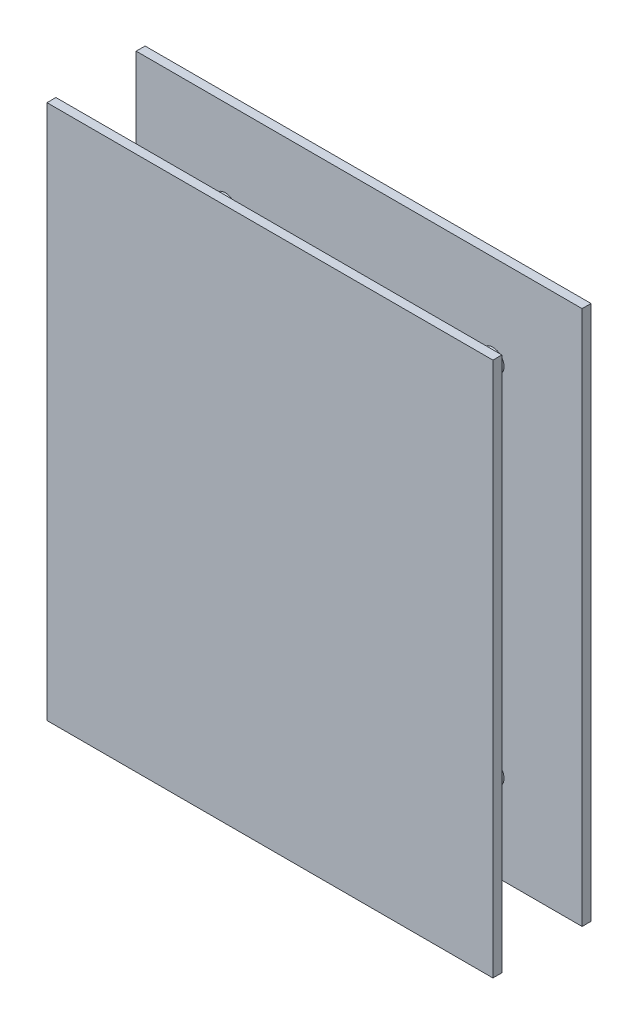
ISO-10303-21;
HEADER;
FILE_DESCRIPTION(('STEP AP214'),'2;1');
FILE_NAME('part.step','',(''),(''),'','','');
FILE_SCHEMA(('AUTOMOTIVE_DESIGN { 1 0 10303 214 1 1 1 1 }'));
ENDSEC;
DATA;
#1=APPLICATION_CONTEXT('core data for automotive mechanical design processes');
#2=APPLICATION_PROTOCOL_DEFINITION('international standard','automotive_design',2000,#1);
#3=PRODUCT_CONTEXT('',#1,'mechanical');
#4=PRODUCT('Part','Part','',(#3));
#5=PRODUCT_RELATED_PRODUCT_CATEGORY('part','',(#4));
#6=PRODUCT_DEFINITION_FORMATION('','',#4);
#7=PRODUCT_DEFINITION_CONTEXT('part definition',#1,'design');
#8=PRODUCT_DEFINITION('design','',#6,#7);
#9=PRODUCT_DEFINITION_SHAPE('','',#8);
#10=(LENGTH_UNIT() NAMED_UNIT(*) SI_UNIT(.MILLI.,.METRE.));
#11=(NAMED_UNIT(*) PLANE_ANGLE_UNIT() SI_UNIT($,.RADIAN.));
#12=(NAMED_UNIT(*) SI_UNIT($,.STERADIAN.) SOLID_ANGLE_UNIT());
#13=UNCERTAINTY_MEASURE_WITH_UNIT(LENGTH_MEASURE(1.E-05),#10,'distance_accuracy_value','');
#14=(GEOMETRIC_REPRESENTATION_CONTEXT(3) GLOBAL_UNCERTAINTY_ASSIGNED_CONTEXT((#13)) GLOBAL_UNIT_ASSIGNED_CONTEXT((#10,
#11,#12)) REPRESENTATION_CONTEXT('',''));
#15=CARTESIAN_POINT('',(0.,0.,0.));
#16=DIRECTION('',(0.,0.,1.));
#17=DIRECTION('',(1.,0.,0.));
#18=AXIS2_PLACEMENT_3D('',#15,#16,#17);
#19=CARTESIAN_POINT('',(0.,120.,2.));
#20=DIRECTION('',(0.,0.,-1.));
#21=DIRECTION('',(-1.,0.,0.));
#22=AXIS2_PLACEMENT_3D('',#19,#20,#21);
#23=PLANE('',#22);
#24=CARTESIAN_POINT('',(25.,72.5,2.));
#25=DIRECTION('',(0.,0.,-1.));
#26=DIRECTION('',(-1.,0.,0.));
#27=AXIS2_PLACEMENT_3D('',#24,#25,#26);
#28=CIRCLE('',#27,1.75);
#29=CARTESIAN_POINT('',(23.25,72.5,2.));
#30=VERTEX_POINT('',#29);
#31=EDGE_CURVE('E420',#30,#30,#28,.T.);
#32=ORIENTED_EDGE('',*,*,#31,.T.);
#33=EDGE_LOOP('',(#32));
#34=FACE_BOUND('',#33,.T.);
#35=CARTESIAN_POINT('',(25.,47.5,2.));
#36=DIRECTION('',(0.,0.,-1.));
#37=DIRECTION('',(-1.,0.,0.));
#38=AXIS2_PLACEMENT_3D('',#35,#36,#37);
#39=CIRCLE('',#38,1.75);
#40=CARTESIAN_POINT('',(23.25,47.5,2.));
#41=VERTEX_POINT('',#40);
#42=EDGE_CURVE('E414',#41,#41,#39,.T.);
#43=ORIENTED_EDGE('',*,*,#42,.T.);
#44=EDGE_LOOP('',(#43));
#45=FACE_BOUND('',#44,.T.);
#46=CARTESIAN_POINT('',(75.,47.5,2.));
#47=DIRECTION('',(0.,0.,-1.));
#48=DIRECTION('',(-1.,0.,0.));
#49=AXIS2_PLACEMENT_3D('',#46,#47,#48);
#50=CIRCLE('',#49,1.75);
#51=CARTESIAN_POINT('',(73.25,47.5,2.));
#52=VERTEX_POINT('',#51);
#53=EDGE_CURVE('E406',#52,#52,#50,.T.);
#54=ORIENTED_EDGE('',*,*,#53,.T.);
#55=EDGE_LOOP('',(#54));
#56=FACE_BOUND('',#55,.T.);
#57=CARTESIAN_POINT('',(75.,72.5,2.));
#58=DIRECTION('',(0.,0.,-1.));
#59=DIRECTION('',(-1.,0.,0.));
#60=AXIS2_PLACEMENT_3D('',#57,#58,#59);
#61=CIRCLE('',#60,1.75);
#62=CARTESIAN_POINT('',(73.25,72.5,2.));
#63=VERTEX_POINT('',#62);
#64=EDGE_CURVE('E399',#63,#63,#61,.T.);
#65=ORIENTED_EDGE('',*,*,#64,.T.);
#66=EDGE_LOOP('',(#65));
#67=FACE_BOUND('',#66,.T.);
#68=CARTESIAN_POINT('',(80.,100.,2.));
#69=DIRECTION('',(0.,0.,-1.));
#70=DIRECTION('',(-1.,0.,0.));
#71=AXIS2_PLACEMENT_3D('',#68,#69,#70);
#72=CIRCLE('',#71,2.50000000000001);
#73=CARTESIAN_POINT('',(77.5,100.,2.));
#74=VERTEX_POINT('',#73);
#75=EDGE_CURVE('E42',#74,#74,#72,.F.);
#76=ORIENTED_EDGE('',*,*,#75,.F.);
#77=EDGE_LOOP('',(#76));
#78=FACE_BOUND('',#77,.T.);
#79=CARTESIAN_POINT('',(20.,20.,2.));
#80=DIRECTION('',(0.,0.,-1.));
#81=DIRECTION('',(-1.,0.,0.));
#82=AXIS2_PLACEMENT_3D('',#79,#80,#81);
#83=CIRCLE('',#82,2.5);
#84=CARTESIAN_POINT('',(17.5,20.,2.));
#85=VERTEX_POINT('',#84);
#86=EDGE_CURVE('E172',#85,#85,#83,.F.);
#87=ORIENTED_EDGE('',*,*,#86,.F.);
#88=EDGE_LOOP('',(#87));
#89=FACE_BOUND('',#88,.T.);
#90=DIRECTION('',(0.,-1.,0.));
#91=VECTOR('',#90,1.);
#92=CARTESIAN_POINT('',(0.,0.,2.));
#93=LINE('',#92,#91);
#94=CARTESIAN_POINT('',(0.,120.,2.));
#95=VERTEX_POINT('',#94);
#96=CARTESIAN_POINT('',(0.,0.,2.));
#97=VERTEX_POINT('',#96);
#98=EDGE_CURVE('E152',#95,#97,#93,.T.);
#99=ORIENTED_EDGE('',*,*,#98,.T.);
#100=DIRECTION('',(1.,0.,0.));
#101=VECTOR('',#100,1.);
#102=CARTESIAN_POINT('',(0.,0.,2.));
#103=LINE('',#102,#101);
#104=CARTESIAN_POINT('',(100.,0.,2.));
#105=VERTEX_POINT('',#104);
#106=EDGE_CURVE('E82',#97,#105,#103,.T.);
#107=ORIENTED_EDGE('',*,*,#106,.T.);
#108=DIRECTION('',(0.,1.,0.));
#109=VECTOR('',#108,1.);
#110=CARTESIAN_POINT('',(100.,0.,2.));
#111=LINE('',#110,#109);
#112=CARTESIAN_POINT('',(100.,120.,2.));
#113=VERTEX_POINT('',#112);
#114=EDGE_CURVE('E155',#105,#113,#111,.T.);
#115=ORIENTED_EDGE('',*,*,#114,.T.);
#116=DIRECTION('',(-1.,0.,0.));
#117=VECTOR('',#116,1.);
#118=CARTESIAN_POINT('',(0.,120.,2.));
#119=LINE('',#118,#117);
#120=EDGE_CURVE('E50',#113,#95,#119,.T.);
#121=ORIENTED_EDGE('',*,*,#120,.T.);
#122=EDGE_LOOP('',(#99,#107,#115,#121));
#123=FACE_BOUND('',#122,.T.);
#124=CARTESIAN_POINT('',(20.,100.,2.));
#125=DIRECTION('',(0.,0.,-1.));
#126=DIRECTION('',(-1.,0.,0.));
#127=AXIS2_PLACEMENT_3D('',#124,#125,#126);
#128=CIRCLE('',#127,2.5);
#129=CARTESIAN_POINT('',(17.5,100.,2.));
#130=VERTEX_POINT('',#129);
#131=EDGE_CURVE('E175',#130,#130,#128,.F.);
#132=ORIENTED_EDGE('',*,*,#131,.F.);
#133=EDGE_LOOP('',(#132));
#134=FACE_BOUND('',#133,.T.);
#135=CARTESIAN_POINT('',(80.,20.,2.));
#136=DIRECTION('',(0.,0.,-1.));
#137=DIRECTION('',(-1.,0.,0.));
#138=AXIS2_PLACEMENT_3D('',#135,#136,#137);
#139=CIRCLE('',#138,2.49999999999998);
#140=CARTESIAN_POINT('',(77.5,20.,2.));
#141=VERTEX_POINT('',#140);
#142=EDGE_CURVE('E11',#141,#141,#139,.F.);
#143=ORIENTED_EDGE('',*,*,#142,.F.);
#144=EDGE_LOOP('',(#143));
#145=FACE_BOUND('',#144,.T.);
#146=ADVANCED_FACE('F33',(#34,#45,#56,#67,#78,#89,#123,#134,#145),#23,.F.);
#147=CARTESIAN_POINT('',(0.,0.,2.));
#148=DIRECTION('',(1.,0.,0.));
#149=DIRECTION('',(0.,0.,-1.));
#150=AXIS2_PLACEMENT_3D('',#147,#148,#149);
#151=PLANE('',#150);
#152=DIRECTION('',(0.,-1.,0.));
#153=VECTOR('',#152,1.);
#154=CARTESIAN_POINT('',(0.,0.,0.));
#155=LINE('',#154,#153);
#156=CARTESIAN_POINT('',(0.,120.,0.));
#157=VERTEX_POINT('',#156);
#158=CARTESIAN_POINT('',(0.,0.,0.));
#159=VERTEX_POINT('',#158);
#160=EDGE_CURVE('E151',#157,#159,#155,.T.);
#161=ORIENTED_EDGE('',*,*,#160,.T.);
#162=DIRECTION('',(0.,0.,-1.));
#163=VECTOR('',#162,1.);
#164=CARTESIAN_POINT('',(0.,0.,2.));
#165=LINE('',#164,#163);
#166=EDGE_CURVE('E170',#97,#159,#165,.T.);
#167=ORIENTED_EDGE('',*,*,#166,.F.);
#168=ORIENTED_EDGE('',*,*,#98,.F.);
#169=DIRECTION('',(0.,0.,-1.));
#170=VECTOR('',#169,1.);
#171=CARTESIAN_POINT('',(0.,120.,2.));
#172=LINE('',#171,#170);
#173=EDGE_CURVE('E158',#95,#157,#172,.T.);
#174=ORIENTED_EDGE('',*,*,#173,.T.);
#175=EDGE_LOOP('',(#161,#167,#168,#174));
#176=FACE_BOUND('',#175,.T.);
#177=ADVANCED_FACE('F35',(#176),#151,.F.);
#178=CARTESIAN_POINT('',(0.,0.,2.));
#179=DIRECTION('',(0.,1.,0.));
#180=DIRECTION('',(0.,0.,1.));
#181=AXIS2_PLACEMENT_3D('',#178,#179,#180);
#182=PLANE('',#181);
#183=DIRECTION('',(1.,0.,0.));
#184=VECTOR('',#183,1.);
#185=CARTESIAN_POINT('',(0.,0.,0.));
#186=LINE('',#185,#184);
#187=CARTESIAN_POINT('',(100.,0.,0.));
#188=VERTEX_POINT('',#187);
#189=EDGE_CURVE('E161',#159,#188,#186,.T.);
#190=ORIENTED_EDGE('',*,*,#189,.T.);
#191=DIRECTION('',(0.,0.,-1.));
#192=VECTOR('',#191,1.);
#193=CARTESIAN_POINT('',(100.,0.,2.));
#194=LINE('',#193,#192);
#195=EDGE_CURVE('E168',#105,#188,#194,.T.);
#196=ORIENTED_EDGE('',*,*,#195,.F.);
#197=ORIENTED_EDGE('',*,*,#106,.F.);
#198=ORIENTED_EDGE('',*,*,#166,.T.);
#199=EDGE_LOOP('',(#190,#196,#197,#198));
#200=FACE_BOUND('',#199,.T.);
#201=ADVANCED_FACE('F228',(#200),#182,.F.);
#202=CARTESIAN_POINT('',(100.,0.,2.));
#203=DIRECTION('',(-1.,0.,0.));
#204=DIRECTION('',(0.,0.,1.));
#205=AXIS2_PLACEMENT_3D('',#202,#203,#204);
#206=PLANE('',#205);
#207=DIRECTION('',(0.,1.,0.));
#208=VECTOR('',#207,1.);
#209=CARTESIAN_POINT('',(100.,0.,0.));
#210=LINE('',#209,#208);
#211=CARTESIAN_POINT('',(100.,120.,0.));
#212=VERTEX_POINT('',#211);
#213=EDGE_CURVE('E68',#188,#212,#210,.T.);
#214=ORIENTED_EDGE('',*,*,#213,.T.);
#215=DIRECTION('',(0.,0.,-1.));
#216=VECTOR('',#215,1.);
#217=CARTESIAN_POINT('',(100.,120.,2.));
#218=LINE('',#217,#216);
#219=EDGE_CURVE('E166',#113,#212,#218,.T.);
#220=ORIENTED_EDGE('',*,*,#219,.F.);
#221=ORIENTED_EDGE('',*,*,#114,.F.);
#222=ORIENTED_EDGE('',*,*,#195,.T.);
#223=EDGE_LOOP('',(#214,#220,#221,#222));
#224=FACE_BOUND('',#223,.T.);
#225=ADVANCED_FACE('F226',(#224),#206,.F.);
#226=CARTESIAN_POINT('',(0.,120.,2.));
#227=DIRECTION('',(0.,-1.,0.));
#228=DIRECTION('',(0.,0.,-1.));
#229=AXIS2_PLACEMENT_3D('',#226,#227,#228);
#230=PLANE('',#229);
#231=DIRECTION('',(-1.,0.,0.));
#232=VECTOR('',#231,1.);
#233=CARTESIAN_POINT('',(0.,120.,0.));
#234=LINE('',#233,#232);
#235=EDGE_CURVE('E74',#212,#157,#234,.T.);
#236=ORIENTED_EDGE('',*,*,#235,.T.);
#237=ORIENTED_EDGE('',*,*,#173,.F.);
#238=ORIENTED_EDGE('',*,*,#120,.F.);
#239=ORIENTED_EDGE('',*,*,#219,.T.);
#240=EDGE_LOOP('',(#236,#237,#238,#239));
#241=FACE_BOUND('',#240,.T.);
#242=ADVANCED_FACE('F222',(#241),#230,.F.);
#243=CARTESIAN_POINT('',(0.,120.,0.));
#244=DIRECTION('',(0.,0.,-1.));
#245=DIRECTION('',(-1.,0.,0.));
#246=AXIS2_PLACEMENT_3D('',#243,#244,#245);
#247=PLANE('',#246);
#248=CARTESIAN_POINT('',(25.,72.5,0.));
#249=DIRECTION('',(0.,0.,-1.));
#250=DIRECTION('',(-1.,0.,0.));
#251=AXIS2_PLACEMENT_3D('',#248,#249,#250);
#252=CIRCLE('',#251,1.75);
#253=CARTESIAN_POINT('',(23.25,72.5,0.));
#254=VERTEX_POINT('',#253);
#255=EDGE_CURVE('E423',#254,#254,#252,.T.);
#256=ORIENTED_EDGE('',*,*,#255,.F.);
#257=EDGE_LOOP('',(#256));
#258=FACE_BOUND('',#257,.T.);
#259=CARTESIAN_POINT('',(25.,47.5,0.));
#260=DIRECTION('',(0.,0.,-1.));
#261=DIRECTION('',(-1.,0.,0.));
#262=AXIS2_PLACEMENT_3D('',#259,#260,#261);
#263=CIRCLE('',#262,1.75);
#264=CARTESIAN_POINT('',(23.25,47.5,0.));
#265=VERTEX_POINT('',#264);
#266=EDGE_CURVE('E417',#265,#265,#263,.T.);
#267=ORIENTED_EDGE('',*,*,#266,.F.);
#268=EDGE_LOOP('',(#267));
#269=FACE_BOUND('',#268,.T.);
#270=CARTESIAN_POINT('',(75.,47.5,0.));
#271=DIRECTION('',(0.,0.,-1.));
#272=DIRECTION('',(-1.,0.,0.));
#273=AXIS2_PLACEMENT_3D('',#270,#271,#272);
#274=CIRCLE('',#273,1.75);
#275=CARTESIAN_POINT('',(73.25,47.5,0.));
#276=VERTEX_POINT('',#275);
#277=EDGE_CURVE('E411',#276,#276,#274,.T.);
#278=ORIENTED_EDGE('',*,*,#277,.F.);
#279=EDGE_LOOP('',(#278));
#280=FACE_BOUND('',#279,.T.);
#281=CARTESIAN_POINT('',(75.,72.5,0.));
#282=DIRECTION('',(0.,0.,-1.));
#283=DIRECTION('',(-1.,0.,0.));
#284=AXIS2_PLACEMENT_3D('',#281,#282,#283);
#285=CIRCLE('',#284,1.75);
#286=CARTESIAN_POINT('',(73.25,72.5,0.));
#287=VERTEX_POINT('',#286);
#288=EDGE_CURVE('E401',#287,#287,#285,.T.);
#289=ORIENTED_EDGE('',*,*,#288,.F.);
#290=EDGE_LOOP('',(#289));
#291=FACE_BOUND('',#290,.T.);
#292=ORIENTED_EDGE('',*,*,#160,.F.);
#293=ORIENTED_EDGE('',*,*,#235,.F.);
#294=ORIENTED_EDGE('',*,*,#213,.F.);
#295=ORIENTED_EDGE('',*,*,#189,.F.);
#296=EDGE_LOOP('',(#292,#293,#294,#295));
#297=FACE_BOUND('',#296,.T.);
#298=ADVANCED_FACE('F217',(#258,#269,#280,#291,#297),#247,.T.);
#299=CARTESIAN_POINT('',(20.,20.,20.));
#300=DIRECTION('',(0.,0.,-1.));
#301=DIRECTION('',(-1.,0.,0.));
#302=AXIS2_PLACEMENT_3D('',#299,#300,#301);
#303=CYLINDRICAL_SURFACE('',#302,2.5);
#304=CARTESIAN_POINT('',(20.,20.,20.));
#305=DIRECTION('',(0.,0.,1.));
#306=DIRECTION('',(1.,0.,0.));
#307=AXIS2_PLACEMENT_3D('',#304,#305,#306);
#308=CIRCLE('',#307,2.5);
#309=CARTESIAN_POINT('',(22.5,20.,20.));
#310=VERTEX_POINT('',#309);
#311=EDGE_CURVE('E148',#310,#310,#308,.T.);
#312=ORIENTED_EDGE('',*,*,#311,.F.);
#313=EDGE_LOOP('',(#312));
#314=FACE_BOUND('',#313,.T.);
#315=ORIENTED_EDGE('',*,*,#86,.T.);
#316=EDGE_LOOP('',(#315));
#317=FACE_BOUND('',#316,.T.);
#318=ADVANCED_FACE('F214',(#314,#317),#303,.T.);
#319=CARTESIAN_POINT('',(20.,100.,20.));
#320=DIRECTION('',(0.,0.,-1.));
#321=DIRECTION('',(-1.,0.,0.));
#322=AXIS2_PLACEMENT_3D('',#319,#320,#321);
#323=CYLINDRICAL_SURFACE('',#322,2.5);
#324=CARTESIAN_POINT('',(20.,100.,20.));
#325=DIRECTION('',(0.,0.,1.));
#326=DIRECTION('',(1.,0.,0.));
#327=AXIS2_PLACEMENT_3D('',#324,#325,#326);
#328=CIRCLE('',#327,2.5);
#329=CARTESIAN_POINT('',(22.5,100.,20.));
#330=VERTEX_POINT('',#329);
#331=EDGE_CURVE('E145',#330,#330,#328,.T.);
#332=ORIENTED_EDGE('',*,*,#331,.F.);
#333=EDGE_LOOP('',(#332));
#334=FACE_BOUND('',#333,.T.);
#335=ORIENTED_EDGE('',*,*,#131,.T.);
#336=EDGE_LOOP('',(#335));
#337=FACE_BOUND('',#336,.T.);
#338=ADVANCED_FACE('F205',(#334,#337),#323,.T.);
#339=CARTESIAN_POINT('',(80.,100.,20.));
#340=DIRECTION('',(0.,0.,-1.));
#341=DIRECTION('',(-1.,0.,0.));
#342=AXIS2_PLACEMENT_3D('',#339,#340,#341);
#343=CYLINDRICAL_SURFACE('',#342,2.50000000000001);
#344=CARTESIAN_POINT('',(80.,100.,20.));
#345=DIRECTION('',(0.,0.,1.));
#346=DIRECTION('',(1.,0.,0.));
#347=AXIS2_PLACEMENT_3D('',#344,#345,#346);
#348=CIRCLE('',#347,2.50000000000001);
#349=CARTESIAN_POINT('',(82.5,100.,20.));
#350=VERTEX_POINT('',#349);
#351=EDGE_CURVE('E137',#350,#350,#348,.T.);
#352=ORIENTED_EDGE('',*,*,#351,.F.);
#353=EDGE_LOOP('',(#352));
#354=FACE_BOUND('',#353,.T.);
#355=ORIENTED_EDGE('',*,*,#75,.T.);
#356=EDGE_LOOP('',(#355));
#357=FACE_BOUND('',#356,.T.);
#358=ADVANCED_FACE('F180',(#354,#357),#343,.T.);
#359=CARTESIAN_POINT('',(80.,20.,20.));
#360=DIRECTION('',(0.,0.,-1.));
#361=DIRECTION('',(-1.,0.,0.));
#362=AXIS2_PLACEMENT_3D('',#359,#360,#361);
#363=CYLINDRICAL_SURFACE('',#362,2.49999999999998);
#364=CARTESIAN_POINT('',(80.,20.,20.));
#365=DIRECTION('',(0.,0.,1.));
#366=DIRECTION('',(1.,0.,0.));
#367=AXIS2_PLACEMENT_3D('',#364,#365,#366);
#368=CIRCLE('',#367,2.49999999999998);
#369=CARTESIAN_POINT('',(82.5,20.,20.));
#370=VERTEX_POINT('',#369);
#371=EDGE_CURVE('E134',#370,#370,#368,.T.);
#372=ORIENTED_EDGE('',*,*,#371,.F.);
#373=EDGE_LOOP('',(#372));
#374=FACE_BOUND('',#373,.T.);
#375=ORIENTED_EDGE('',*,*,#142,.T.);
#376=EDGE_LOOP('',(#375));
#377=FACE_BOUND('',#376,.T.);
#378=ADVANCED_FACE('F194',(#374,#377),#363,.T.);
#379=CARTESIAN_POINT('',(0.,0.,20.));
#380=DIRECTION('',(0.,0.,1.));
#381=DIRECTION('',(1.,0.,0.));
#382=AXIS2_PLACEMENT_3D('',#379,#380,#381);
#383=PLANE('',#382);
#384=ORIENTED_EDGE('',*,*,#331,.T.);
#385=EDGE_LOOP('',(#384));
#386=FACE_BOUND('',#385,.T.);
#387=ORIENTED_EDGE('',*,*,#371,.T.);
#388=EDGE_LOOP('',(#387));
#389=FACE_BOUND('',#388,.T.);
#390=DIRECTION('',(0.,-1.,0.));
#391=VECTOR('',#390,1.);
#392=CARTESIAN_POINT('',(0.,120.,20.));
#393=LINE('',#392,#391);
#394=CARTESIAN_POINT('',(0.,120.,20.));
#395=VERTEX_POINT('',#394);
#396=CARTESIAN_POINT('',(0.,0.,20.));
#397=VERTEX_POINT('',#396);
#398=EDGE_CURVE('E133',#395,#397,#393,.T.);
#399=ORIENTED_EDGE('',*,*,#398,.F.);
#400=DIRECTION('',(-1.,0.,0.));
#401=VECTOR('',#400,1.);
#402=CARTESIAN_POINT('',(0.,120.,20.));
#403=LINE('',#402,#401);
#404=CARTESIAN_POINT('',(100.,120.,20.));
#405=VERTEX_POINT('',#404);
#406=EDGE_CURVE('E129',#405,#395,#403,.T.);
#407=ORIENTED_EDGE('',*,*,#406,.F.);
#408=DIRECTION('',(0.,1.,0.));
#409=VECTOR('',#408,1.);
#410=CARTESIAN_POINT('',(100.,120.,20.));
#411=LINE('',#410,#409);
#412=CARTESIAN_POINT('',(100.,0.,20.));
#413=VERTEX_POINT('',#412);
#414=EDGE_CURVE('E385',#413,#405,#411,.T.);
#415=ORIENTED_EDGE('',*,*,#414,.F.);
#416=DIRECTION('',(1.,0.,0.));
#417=VECTOR('',#416,1.);
#418=CARTESIAN_POINT('',(0.,0.,20.));
#419=LINE('',#418,#417);
#420=EDGE_CURVE('E389',#397,#413,#419,.T.);
#421=ORIENTED_EDGE('',*,*,#420,.F.);
#422=EDGE_LOOP('',(#399,#407,#415,#421));
#423=FACE_BOUND('',#422,.T.);
#424=ORIENTED_EDGE('',*,*,#351,.T.);
#425=EDGE_LOOP('',(#424));
#426=FACE_BOUND('',#425,.T.);
#427=ORIENTED_EDGE('',*,*,#311,.T.);
#428=EDGE_LOOP('',(#427));
#429=FACE_BOUND('',#428,.T.);
#430=ADVANCED_FACE('F196',(#386,#389,#423,#426,#429),#383,.F.);
#431=CARTESIAN_POINT('',(0.,120.,22.));
#432=DIRECTION('',(1.,0.,0.));
#433=DIRECTION('',(0.,0.,-1.));
#434=AXIS2_PLACEMENT_3D('',#431,#432,#433);
#435=PLANE('',#434);
#436=ORIENTED_EDGE('',*,*,#398,.T.);
#437=DIRECTION('',(0.,0.,-1.));
#438=VECTOR('',#437,1.);
#439=CARTESIAN_POINT('',(0.,0.,22.));
#440=LINE('',#439,#438);
#441=CARTESIAN_POINT('',(0.,0.,22.));
#442=VERTEX_POINT('',#441);
#443=EDGE_CURVE('E113',#442,#397,#440,.T.);
#444=ORIENTED_EDGE('',*,*,#443,.F.);
#445=DIRECTION('',(0.,-1.,0.));
#446=VECTOR('',#445,1.);
#447=CARTESIAN_POINT('',(0.,120.,22.));
#448=LINE('',#447,#446);
#449=CARTESIAN_POINT('',(0.,120.,22.));
#450=VERTEX_POINT('',#449);
#451=EDGE_CURVE('E120',#450,#442,#448,.T.);
#452=ORIENTED_EDGE('',*,*,#451,.F.);
#453=DIRECTION('',(0.,0.,-1.));
#454=VECTOR('',#453,1.);
#455=CARTESIAN_POINT('',(0.,120.,22.));
#456=LINE('',#455,#454);
#457=EDGE_CURVE('E391',#450,#395,#456,.T.);
#458=ORIENTED_EDGE('',*,*,#457,.T.);
#459=EDGE_LOOP('',(#436,#444,#452,#458));
#460=FACE_BOUND('',#459,.T.);
#461=ADVANCED_FACE('F131',(#460),#435,.F.);
#462=CARTESIAN_POINT('',(0.,0.,22.));
#463=DIRECTION('',(0.,1.,0.));
#464=DIRECTION('',(0.,0.,1.));
#465=AXIS2_PLACEMENT_3D('',#462,#463,#464);
#466=PLANE('',#465);
#467=ORIENTED_EDGE('',*,*,#420,.T.);
#468=DIRECTION('',(0.,0.,-1.));
#469=VECTOR('',#468,1.);
#470=CARTESIAN_POINT('',(100.,0.,22.));
#471=LINE('',#470,#469);
#472=CARTESIAN_POINT('',(100.,0.,22.));
#473=VERTEX_POINT('',#472);
#474=EDGE_CURVE('E116',#473,#413,#471,.T.);
#475=ORIENTED_EDGE('',*,*,#474,.F.);
#476=DIRECTION('',(1.,0.,0.));
#477=VECTOR('',#476,1.);
#478=CARTESIAN_POINT('',(0.,0.,22.));
#479=LINE('',#478,#477);
#480=EDGE_CURVE('E109',#442,#473,#479,.T.);
#481=ORIENTED_EDGE('',*,*,#480,.F.);
#482=ORIENTED_EDGE('',*,*,#443,.T.);
#483=EDGE_LOOP('',(#467,#475,#481,#482));
#484=FACE_BOUND('',#483,.T.);
#485=ADVANCED_FACE('F111',(#484),#466,.F.);
#486=CARTESIAN_POINT('',(100.,120.,22.));
#487=DIRECTION('',(-1.,0.,0.));
#488=DIRECTION('',(0.,0.,1.));
#489=AXIS2_PLACEMENT_3D('',#486,#487,#488);
#490=PLANE('',#489);
#491=ORIENTED_EDGE('',*,*,#414,.T.);
#492=DIRECTION('',(0.,0.,-1.));
#493=VECTOR('',#492,1.);
#494=CARTESIAN_POINT('',(100.,120.,22.));
#495=LINE('',#494,#493);
#496=CARTESIAN_POINT('',(100.,120.,22.));
#497=VERTEX_POINT('',#496);
#498=EDGE_CURVE('E139',#497,#405,#495,.T.);
#499=ORIENTED_EDGE('',*,*,#498,.F.);
#500=DIRECTION('',(0.,1.,0.));
#501=VECTOR('',#500,1.);
#502=CARTESIAN_POINT('',(100.,120.,22.));
#503=LINE('',#502,#501);
#504=EDGE_CURVE('E119',#473,#497,#503,.T.);
#505=ORIENTED_EDGE('',*,*,#504,.F.);
#506=ORIENTED_EDGE('',*,*,#474,.T.);
#507=EDGE_LOOP('',(#491,#499,#505,#506));
#508=FACE_BOUND('',#507,.T.);
#509=ADVANCED_FACE('F307',(#508),#490,.F.);
#510=CARTESIAN_POINT('',(0.,120.,22.));
#511=DIRECTION('',(0.,-1.,0.));
#512=DIRECTION('',(0.,0.,-1.));
#513=AXIS2_PLACEMENT_3D('',#510,#511,#512);
#514=PLANE('',#513);
#515=ORIENTED_EDGE('',*,*,#406,.T.);
#516=ORIENTED_EDGE('',*,*,#457,.F.);
#517=DIRECTION('',(-1.,0.,0.));
#518=VECTOR('',#517,1.);
#519=CARTESIAN_POINT('',(0.,120.,22.));
#520=LINE('',#519,#518);
#521=EDGE_CURVE('E125',#497,#450,#520,.T.);
#522=ORIENTED_EDGE('',*,*,#521,.F.);
#523=ORIENTED_EDGE('',*,*,#498,.T.);
#524=EDGE_LOOP('',(#515,#516,#522,#523));
#525=FACE_BOUND('',#524,.T.);
#526=ADVANCED_FACE('F303',(#525),#514,.F.);
#527=CARTESIAN_POINT('',(0.,0.,22.));
#528=DIRECTION('',(0.,0.,1.));
#529=DIRECTION('',(1.,0.,0.));
#530=AXIS2_PLACEMENT_3D('',#527,#528,#529);
#531=PLANE('',#530);
#532=ORIENTED_EDGE('',*,*,#451,.T.);
#533=ORIENTED_EDGE('',*,*,#480,.T.);
#534=ORIENTED_EDGE('',*,*,#504,.T.);
#535=ORIENTED_EDGE('',*,*,#521,.T.);
#536=EDGE_LOOP('',(#532,#533,#534,#535));
#537=FACE_BOUND('',#536,.T.);
#538=ADVANCED_FACE('F123',(#537),#531,.T.);
#539=CARTESIAN_POINT('',(75.,72.5,10.));
#540=DIRECTION('',(0.,0.,-1.));
#541=DIRECTION('',(-1.,0.,0.));
#542=AXIS2_PLACEMENT_3D('',#539,#540,#541);
#543=CYLINDRICAL_SURFACE('',#542,1.75);
#544=ORIENTED_EDGE('',*,*,#288,.T.);
#545=EDGE_LOOP('',(#544));
#546=FACE_BOUND('',#545,.T.);
#547=ORIENTED_EDGE('',*,*,#64,.F.);
#548=EDGE_LOOP('',(#547));
#549=FACE_BOUND('',#548,.T.);
#550=ADVANCED_FACE('F261',(#546,#549),#543,.F.);
#551=CARTESIAN_POINT('',(75.,47.5,10.));
#552=DIRECTION('',(0.,0.,-1.));
#553=DIRECTION('',(-1.,0.,0.));
#554=AXIS2_PLACEMENT_3D('',#551,#552,#553);
#555=CYLINDRICAL_SURFACE('',#554,1.75);
#556=ORIENTED_EDGE('',*,*,#277,.T.);
#557=EDGE_LOOP('',(#556));
#558=FACE_BOUND('',#557,.T.);
#559=ORIENTED_EDGE('',*,*,#53,.F.);
#560=EDGE_LOOP('',(#559));
#561=FACE_BOUND('',#560,.T.);
#562=ADVANCED_FACE('F266',(#558,#561),#555,.F.);
#563=CARTESIAN_POINT('',(25.,47.5,10.));
#564=DIRECTION('',(0.,0.,-1.));
#565=DIRECTION('',(-1.,0.,0.));
#566=AXIS2_PLACEMENT_3D('',#563,#564,#565);
#567=CYLINDRICAL_SURFACE('',#566,1.75);
#568=ORIENTED_EDGE('',*,*,#266,.T.);
#569=EDGE_LOOP('',(#568));
#570=FACE_BOUND('',#569,.T.);
#571=ORIENTED_EDGE('',*,*,#42,.F.);
#572=EDGE_LOOP('',(#571));
#573=FACE_BOUND('',#572,.T.);
#574=ADVANCED_FACE('F276',(#570,#573),#567,.F.);
#575=CARTESIAN_POINT('',(25.,72.5,10.));
#576=DIRECTION('',(0.,0.,-1.));
#577=DIRECTION('',(-1.,0.,0.));
#578=AXIS2_PLACEMENT_3D('',#575,#576,#577);
#579=CYLINDRICAL_SURFACE('',#578,1.75);
#580=ORIENTED_EDGE('',*,*,#255,.T.);
#581=EDGE_LOOP('',(#580));
#582=FACE_BOUND('',#581,.T.);
#583=ORIENTED_EDGE('',*,*,#31,.F.);
#584=EDGE_LOOP('',(#583));
#585=FACE_BOUND('',#584,.T.);
#586=ADVANCED_FACE('F286',(#582,#585),#579,.F.);
#587=CLOSED_SHELL('',(#146,#177,#201,#225,#242,#298,#318,#338,#358,#378,#430,#461,#485,#509,
#526,#538,#550,#562,#574,#586));
#588=MANIFOLD_SOLID_BREP('B2',#587);
#589=ADVANCED_BREP_SHAPE_REPRESENTATION('',(#18,#588),#14);
#590=SHAPE_DEFINITION_REPRESENTATION(#9,#589);
ENDSEC;
END-ISO-10303-21;
